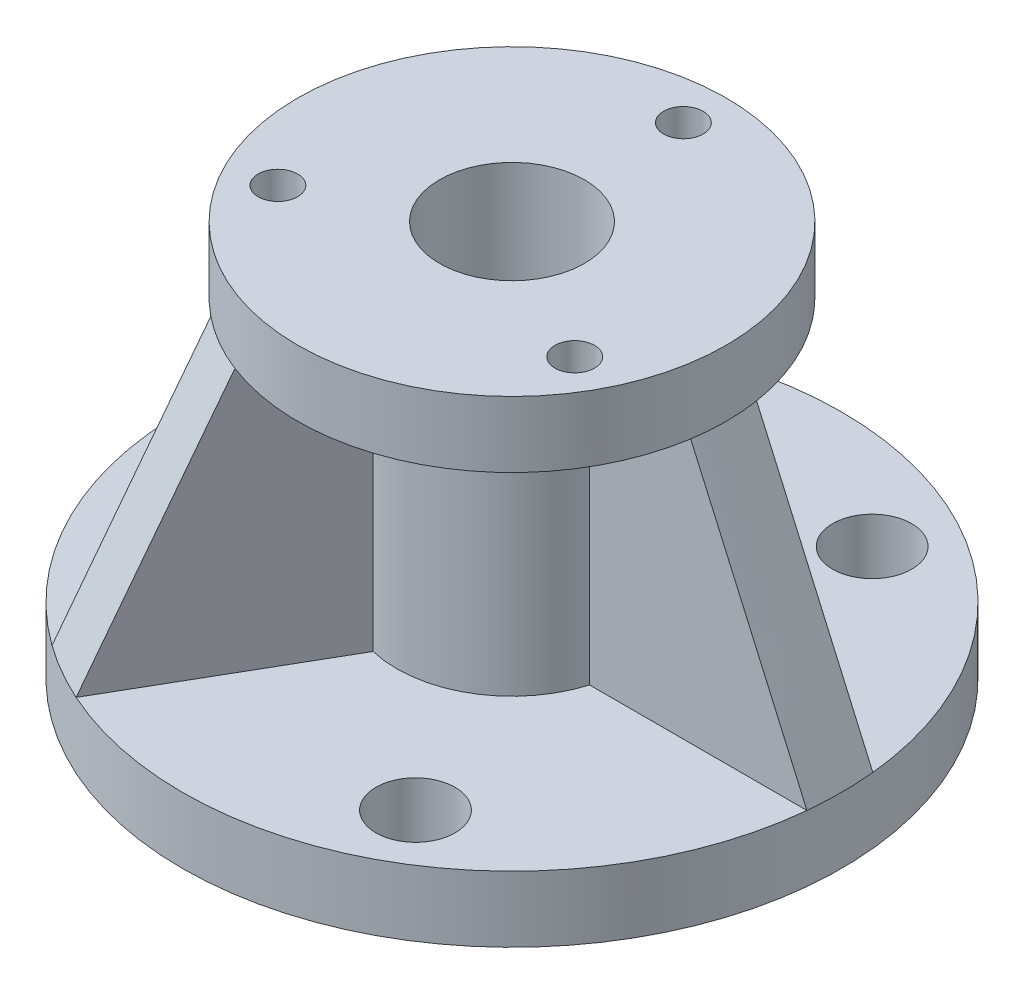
ISO-10303-21;
HEADER;
FILE_DESCRIPTION(('STEP AP214'),'2;1');
FILE_NAME('part.step','',(''),(''),'','','');
FILE_SCHEMA(('AUTOMOTIVE_DESIGN { 1 0 10303 214 1 1 1 1 }'));
ENDSEC;
DATA;
#1=APPLICATION_CONTEXT('core data for automotive mechanical design processes');
#2=APPLICATION_PROTOCOL_DEFINITION('international standard','automotive_design',2000,#1);
#3=PRODUCT_CONTEXT('',#1,'mechanical');
#4=PRODUCT('Part','Part','',(#3));
#5=PRODUCT_RELATED_PRODUCT_CATEGORY('part','',(#4));
#6=PRODUCT_DEFINITION_FORMATION('','',#4);
#7=PRODUCT_DEFINITION_CONTEXT('part definition',#1,'design');
#8=PRODUCT_DEFINITION('design','',#6,#7);
#9=PRODUCT_DEFINITION_SHAPE('','',#8);
#10=(LENGTH_UNIT() NAMED_UNIT(*) SI_UNIT(.MILLI.,.METRE.));
#11=(NAMED_UNIT(*) PLANE_ANGLE_UNIT() SI_UNIT($,.RADIAN.));
#12=(NAMED_UNIT(*) SI_UNIT($,.STERADIAN.) SOLID_ANGLE_UNIT());
#13=UNCERTAINTY_MEASURE_WITH_UNIT(LENGTH_MEASURE(1.E-05),#10,'distance_accuracy_value','');
#14=(GEOMETRIC_REPRESENTATION_CONTEXT(3) GLOBAL_UNCERTAINTY_ASSIGNED_CONTEXT((#13)) GLOBAL_UNIT_ASSIGNED_CONTEXT((#10,
#11,#12)) REPRESENTATION_CONTEXT('',''));
#15=CARTESIAN_POINT('',(0.,0.,0.));
#16=DIRECTION('',(0.,0.,1.));
#17=DIRECTION('',(1.,0.,0.));
#18=AXIS2_PLACEMENT_3D('',#15,#16,#17);
#19=CARTESIAN_POINT('',(-110.141421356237,10.,0.));
#20=DIRECTION('',(0.,1.,0.));
#21=DIRECTION('',(0.,0.,1.));
#22=AXIS2_PLACEMENT_3D('',#19,#20,#21);
#23=PLANE('',#22);
#24=CARTESIAN_POINT('',(19.9999999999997,10.,34.6410161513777));
#25=DIRECTION('',(0.,1.,0.));
#26=DIRECTION('',(0.,0.,1.));
#27=AXIS2_PLACEMENT_3D('',#24,#25,#26);
#28=CIRCLE('',#27,6.);
#29=CARTESIAN_POINT('',(19.9999999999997,10.,40.6410161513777));
#30=VERTEX_POINT('',#29);
#31=EDGE_CURVE('E364',#30,#30,#28,.T.);
#32=ORIENTED_EDGE('',*,*,#31,.F.);
#33=EDGE_LOOP('',(#32));
#34=FACE_BOUND('',#33,.T.);
#35=CARTESIAN_POINT('',(0.,10.,0.));
#36=DIRECTION('',(0.,1.,0.));
#37=DIRECTION('',(0.,0.,1.));
#38=AXIS2_PLACEMENT_3D('',#35,#36,#37);
#39=CIRCLE('',#38,17.5);
#40=CARTESIAN_POINT('',(-4.05512789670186,10.,17.0236875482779));
#41=VERTEX_POINT('',#40);
#42=CARTESIAN_POINT('',(16.7705098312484,10.,5.));
#43=VERTEX_POINT('',#42);
#44=EDGE_CURVE('E59',#41,#43,#39,.T.);
#45=ORIENTED_EDGE('',*,*,#44,.F.);
#46=DIRECTION('',(-0.499999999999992,0.,0.866025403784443));
#47=VECTOR('',#46,1.);
#48=CARTESIAN_POINT('',(4.33012701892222,10.,2.49999999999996));
#49=LINE('',#48,#47);
#50=CARTESIAN_POINT('',(-20.5445589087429,10.,45.5842198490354));
#51=VERTEX_POINT('',#50);
#52=EDGE_CURVE('E296',#51,#41,#49,.F.);
#53=ORIENTED_EDGE('',*,*,#52,.F.);
#54=CARTESIAN_POINT('',(0.,10.,0.));
#55=DIRECTION('',(0.,1.,0.));
#56=DIRECTION('',(0.,0.,1.));
#57=AXIS2_PLACEMENT_3D('',#54,#55,#56);
#58=CIRCLE('',#57,50.);
#59=CARTESIAN_POINT('',(49.7493718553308,10.,4.99999999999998));
#60=VERTEX_POINT('',#59);
#61=EDGE_CURVE('E259',#51,#60,#58,.T.);
#62=ORIENTED_EDGE('',*,*,#61,.T.);
#63=DIRECTION('',(1.,0.,0.));
#64=VECTOR('',#63,1.);
#65=CARTESIAN_POINT('',(0.,10.,5.));
#66=LINE('',#65,#64);
#67=EDGE_CURVE('E348',#60,#43,#66,.F.);
#68=ORIENTED_EDGE('',*,*,#67,.T.);
#69=EDGE_LOOP('',(#45,#53,#62,#68));
#70=FACE_BOUND('',#69,.T.);
#71=ADVANCED_FACE('F31',(#34,#70),#23,.T.);
#72=CARTESIAN_POINT('',(0.,50.,0.));
#73=DIRECTION('',(0.,1.,0.));
#74=DIRECTION('',(0.,0.,1.));
#75=AXIS2_PLACEMENT_3D('',#72,#73,#74);
#76=PLANE('',#75);
#77=CARTESIAN_POINT('',(22.5166604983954,50.,13.0000000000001));
#78=DIRECTION('',(0.,1.,0.));
#79=DIRECTION('',(0.,0.,1.));
#80=AXIS2_PLACEMENT_3D('',#77,#78,#79);
#81=CIRCLE('',#80,3.);
#82=CARTESIAN_POINT('',(22.5166604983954,50.,16.0000000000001));
#83=VERTEX_POINT('',#82);
#84=EDGE_CURVE('E332',#83,#83,#81,.T.);
#85=ORIENTED_EDGE('',*,*,#84,.T.);
#86=EDGE_LOOP('',(#85));
#87=FACE_BOUND('',#86,.T.);
#88=DIRECTION('',(-0.499999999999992,0.,0.866025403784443));
#89=VECTOR('',#88,1.);
#90=CARTESIAN_POINT('',(4.33012701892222,50.,2.49999999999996));
#91=LINE('',#90,#89);
#92=CARTESIAN_POINT('',(-4.05512789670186,50.,17.0236875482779));
#93=VERTEX_POINT('',#92);
#94=CARTESIAN_POINT('',(-11.7264137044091,49.9999999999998,30.3107443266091));
#95=VERTEX_POINT('',#94);
#96=EDGE_CURVE('E150',#93,#95,#91,.T.);
#97=ORIENTED_EDGE('',*,*,#96,.F.);
#98=CARTESIAN_POINT('',(0.,50.,0.));
#99=DIRECTION('',(0.,1.,0.));
#100=DIRECTION('',(0.,0.,1.));
#101=AXIS2_PLACEMENT_3D('',#98,#99,#100);
#102=CIRCLE('',#101,17.5);
#103=CARTESIAN_POINT('',(16.7705098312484,50.,5.));
#104=VERTEX_POINT('',#103);
#105=EDGE_CURVE('E324',#93,#104,#102,.T.);
#106=ORIENTED_EDGE('',*,*,#105,.T.);
#107=DIRECTION('',(1.,0.,0.));
#108=VECTOR('',#107,1.);
#109=CARTESIAN_POINT('',(0.,50.,5.));
#110=LINE('',#109,#108);
#111=CARTESIAN_POINT('',(32.1130814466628,50.,5.));
#112=VERTEX_POINT('',#111);
#113=EDGE_CURVE('E315',#104,#112,#110,.T.);
#114=ORIENTED_EDGE('',*,*,#113,.T.);
#115=CARTESIAN_POINT('',(0.,50.,0.));
#116=DIRECTION('',(0.,1.,0.));
#117=DIRECTION('',(0.,0.,1.));
#118=AXIS2_PLACEMENT_3D('',#115,#116,#117);
#119=CIRCLE('',#118,32.5);
#120=EDGE_CURVE('E313',#95,#112,#119,.T.);
#121=ORIENTED_EDGE('',*,*,#120,.F.);
#122=EDGE_LOOP('',(#97,#106,#114,#121));
#123=FACE_BOUND('',#122,.T.);
#124=ADVANCED_FACE('F215',(#87,#123),#76,.F.);
#125=CARTESIAN_POINT('',(0.,-8.,0.));
#126=DIRECTION('',(0.,1.,0.));
#127=DIRECTION('',(0.,0.,1.));
#128=AXIS2_PLACEMENT_3D('',#125,#126,#127);
#129=CYLINDRICAL_SURFACE('',#128,17.5);
#130=ORIENTED_EDGE('',*,*,#105,.F.);
#131=DIRECTION('',(0.,1.,0.));
#132=VECTOR('',#131,1.);
#133=CARTESIAN_POINT('',(-4.05512789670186,-8.,17.0236875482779));
#134=LINE('',#133,#132);
#135=EDGE_CURVE('E292',#93,#41,#134,.F.);
#136=ORIENTED_EDGE('',*,*,#135,.T.);
#137=ORIENTED_EDGE('',*,*,#44,.T.);
#138=DIRECTION('',(0.,1.,0.));
#139=VECTOR('',#138,1.);
#140=CARTESIAN_POINT('',(16.7705098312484,-8.,5.));
#141=LINE('',#140,#139);
#142=EDGE_CURVE('E341',#104,#43,#141,.F.);
#143=ORIENTED_EDGE('',*,*,#142,.F.);
#144=EDGE_LOOP('',(#130,#136,#137,#143));
#145=FACE_BOUND('',#144,.T.);
#146=ADVANCED_FACE('F223',(#145),#129,.T.);
#147=DIRECTION('',(-0.499999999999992,0.,0.866025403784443));
#148=VECTOR('',#147,1.);
#149=CARTESIAN_POINT('',(-4.33012701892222,10.,-2.49999999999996));
#150=LINE('',#149,#148);
#151=CARTESIAN_POINT('',(-29.2048129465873,9.99999999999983,40.5842198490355));
#152=VERTEX_POINT('',#151);
#153=CARTESIAN_POINT('',(-12.7153819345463,10.,12.0236875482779));
#154=VERTEX_POINT('',#153);
#155=EDGE_CURVE('E289',#152,#154,#150,.F.);
#156=ORIENTED_EDGE('',*,*,#155,.T.);
#157=CARTESIAN_POINT('',(-12.7153819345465,9.99999999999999,-12.0236875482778));
#158=VERTEX_POINT('',#157);
#159=EDGE_CURVE('E274',#158,#154,#39,.T.);
#160=ORIENTED_EDGE('',*,*,#159,.F.);
#161=DIRECTION('',(-0.500000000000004,0.,-0.866025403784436));
#162=VECTOR('',#161,1.);
#163=CARTESIAN_POINT('',(-4.33012701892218,9.99999999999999,2.50000000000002));
#164=LINE('',#163,#162);
#165=CARTESIAN_POINT('',(-29.2048129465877,10.,-40.5842198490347));
#166=VERTEX_POINT('',#165);
#167=EDGE_CURVE('E160',#166,#158,#164,.F.);
#168=ORIENTED_EDGE('',*,*,#167,.F.);
#169=EDGE_CURVE('E257',#166,#152,#58,.T.);
#170=ORIENTED_EDGE('',*,*,#169,.T.);
#171=EDGE_LOOP('',(#156,#160,#168,#170));
#172=FACE_BOUND('',#171,.T.);
#173=CARTESIAN_POINT('',(-40.,10.,0.));
#174=DIRECTION('',(0.,1.,0.));
#175=DIRECTION('',(0.,0.,1.));
#176=AXIS2_PLACEMENT_3D('',#173,#174,#175);
#177=CIRCLE('',#176,5.99999999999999);
#178=CARTESIAN_POINT('',(-40.,10.,5.99999999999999));
#179=VERTEX_POINT('',#178);
#180=EDGE_CURVE('E368',#179,#179,#177,.T.);
#181=ORIENTED_EDGE('',*,*,#180,.F.);
#182=EDGE_LOOP('',(#181));
#183=FACE_BOUND('',#182,.T.);
#184=ADVANCED_FACE('F218',(#172,#183),#23,.T.);
#185=DIRECTION('',(0.,1.,0.));
#186=VECTOR('',#185,1.);
#187=CARTESIAN_POINT('',(-4.0551278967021,-8.,-17.0236875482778));
#188=LINE('',#187,#186);
#189=CARTESIAN_POINT('',(-4.05512789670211,50.,-17.0236875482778));
#190=VERTEX_POINT('',#189);
#191=CARTESIAN_POINT('',(-4.0551278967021,9.99999999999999,-17.0236875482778));
#192=VERTEX_POINT('',#191);
#193=EDGE_CURVE('E172',#190,#192,#188,.F.);
#194=ORIENTED_EDGE('',*,*,#193,.F.);
#195=CARTESIAN_POINT('',(16.7705098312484,50.,-5.));
#196=VERTEX_POINT('',#195);
#197=EDGE_CURVE('E159',#196,#190,#102,.T.);
#198=ORIENTED_EDGE('',*,*,#197,.F.);
#199=DIRECTION('',(0.,1.,0.));
#200=VECTOR('',#199,1.);
#201=CARTESIAN_POINT('',(16.7705098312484,-8.,-5.));
#202=LINE('',#201,#200);
#203=CARTESIAN_POINT('',(16.7705098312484,10.,-5.));
#204=VERTEX_POINT('',#203);
#205=EDGE_CURVE('E345',#196,#204,#202,.F.);
#206=ORIENTED_EDGE('',*,*,#205,.T.);
#207=EDGE_CURVE('E44',#204,#192,#39,.T.);
#208=ORIENTED_EDGE('',*,*,#207,.T.);
#209=EDGE_LOOP('',(#194,#198,#206,#208));
#210=FACE_BOUND('',#209,.T.);
#211=ADVANCED_FACE('F232',(#210),#129,.T.);
#212=CARTESIAN_POINT('',(-12.7153819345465,50.,-12.0236875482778));
#213=VERTEX_POINT('',#212);
#214=CARTESIAN_POINT('',(-12.7153819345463,50.,12.0236875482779));
#215=VERTEX_POINT('',#214);
#216=EDGE_CURVE('E327',#213,#215,#102,.T.);
#217=ORIENTED_EDGE('',*,*,#216,.T.);
#218=DIRECTION('',(-0.499999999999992,0.,0.866025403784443));
#219=VECTOR('',#218,1.);
#220=CARTESIAN_POINT('',(-4.33012701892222,50.,-2.49999999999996));
#221=LINE('',#220,#219);
#222=CARTESIAN_POINT('',(-20.3866677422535,49.9999999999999,25.3107443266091));
#223=VERTEX_POINT('',#222);
#224=EDGE_CURVE('E293',#215,#223,#221,.T.);
#225=ORIENTED_EDGE('',*,*,#224,.T.);
#226=CARTESIAN_POINT('',(-20.3866677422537,50.,-25.3107443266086));
#227=VERTEX_POINT('',#226);
#228=EDGE_CURVE('E137',#227,#223,#119,.T.);
#229=ORIENTED_EDGE('',*,*,#228,.F.);
#230=DIRECTION('',(-0.500000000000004,0.,-0.866025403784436));
#231=VECTOR('',#230,1.);
#232=CARTESIAN_POINT('',(-4.33012701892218,50.,2.50000000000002));
#233=LINE('',#232,#231);
#234=EDGE_CURVE('E164',#213,#227,#233,.T.);
#235=ORIENTED_EDGE('',*,*,#234,.F.);
#236=EDGE_LOOP('',(#217,#225,#229,#235));
#237=FACE_BOUND('',#236,.T.);
#238=CARTESIAN_POINT('',(-22.5166604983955,50.,12.9999999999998));
#239=DIRECTION('',(0.,1.,0.));
#240=DIRECTION('',(0.,0.,1.));
#241=AXIS2_PLACEMENT_3D('',#238,#239,#240);
#242=CIRCLE('',#241,3.);
#243=CARTESIAN_POINT('',(-22.5166604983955,50.,15.9999999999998));
#244=VERTEX_POINT('',#243);
#245=EDGE_CURVE('E338',#244,#244,#242,.T.);
#246=ORIENTED_EDGE('',*,*,#245,.T.);
#247=EDGE_LOOP('',(#246));
#248=FACE_BOUND('',#247,.T.);
#249=ADVANCED_FACE('F226',(#237,#248),#76,.F.);
#250=CARTESIAN_POINT('',(-40.,10.,0.));
#251=DIRECTION('',(0.,-1.,0.));
#252=DIRECTION('',(0.,0.,-1.));
#253=AXIS2_PLACEMENT_3D('',#250,#251,#252);
#254=CYLINDRICAL_SURFACE('',#253,5.99999999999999);
#255=ORIENTED_EDGE('',*,*,#180,.T.);
#256=EDGE_LOOP('',(#255));
#257=FACE_BOUND('',#256,.T.);
#258=CARTESIAN_POINT('',(-40.,0.,0.));
#259=DIRECTION('',(0.,1.,0.));
#260=DIRECTION('',(0.,0.,1.));
#261=AXIS2_PLACEMENT_3D('',#258,#259,#260);
#262=CIRCLE('',#261,5.99999999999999);
#263=CARTESIAN_POINT('',(-40.,0.,5.99999999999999));
#264=VERTEX_POINT('',#263);
#265=EDGE_CURVE('E379',#264,#264,#262,.T.);
#266=ORIENTED_EDGE('',*,*,#265,.F.);
#267=EDGE_LOOP('',(#266));
#268=FACE_BOUND('',#267,.T.);
#269=ADVANCED_FACE('F372',(#257,#268),#254,.F.);
#270=CARTESIAN_POINT('',(20.0000000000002,10.,-34.6410161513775));
#271=DIRECTION('',(0.,-1.,0.));
#272=DIRECTION('',(0.,0.,-1.));
#273=AXIS2_PLACEMENT_3D('',#270,#271,#272);
#274=CYLINDRICAL_SURFACE('',#273,6.);
#275=CARTESIAN_POINT('',(20.0000000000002,10.,-34.6410161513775));
#276=DIRECTION('',(0.,1.,0.));
#277=DIRECTION('',(0.,0.,1.));
#278=AXIS2_PLACEMENT_3D('',#275,#276,#277);
#279=CIRCLE('',#278,6.);
#280=CARTESIAN_POINT('',(20.0000000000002,10.,-28.6410161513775));
#281=VERTEX_POINT('',#280);
#282=EDGE_CURVE('E249',#281,#281,#279,.T.);
#283=ORIENTED_EDGE('',*,*,#282,.T.);
#284=EDGE_LOOP('',(#283));
#285=FACE_BOUND('',#284,.T.);
#286=CARTESIAN_POINT('',(20.0000000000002,0.,-34.6410161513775));
#287=DIRECTION('',(0.,1.,0.));
#288=DIRECTION('',(0.,0.,1.));
#289=AXIS2_PLACEMENT_3D('',#286,#287,#288);
#290=CIRCLE('',#289,6.);
#291=CARTESIAN_POINT('',(20.0000000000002,0.,-28.6410161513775));
#292=VERTEX_POINT('',#291);
#293=EDGE_CURVE('E381',#292,#292,#290,.T.);
#294=ORIENTED_EDGE('',*,*,#293,.F.);
#295=EDGE_LOOP('',(#294));
#296=FACE_BOUND('',#295,.T.);
#297=ADVANCED_FACE('F375',(#285,#296),#274,.F.);
#298=CARTESIAN_POINT('',(19.9999999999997,10.,34.6410161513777));
#299=DIRECTION('',(0.,-1.,0.));
#300=DIRECTION('',(0.,0.,-1.));
#301=AXIS2_PLACEMENT_3D('',#298,#299,#300);
#302=CYLINDRICAL_SURFACE('',#301,6.);
#303=ORIENTED_EDGE('',*,*,#31,.T.);
#304=EDGE_LOOP('',(#303));
#305=FACE_BOUND('',#304,.T.);
#306=CARTESIAN_POINT('',(19.9999999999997,0.,34.6410161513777));
#307=DIRECTION('',(0.,1.,0.));
#308=DIRECTION('',(0.,0.,1.));
#309=AXIS2_PLACEMENT_3D('',#306,#307,#308);
#310=CIRCLE('',#309,6.);
#311=CARTESIAN_POINT('',(19.9999999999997,0.,40.6410161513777));
#312=VERTEX_POINT('',#311);
#313=EDGE_CURVE('E386',#312,#312,#310,.T.);
#314=ORIENTED_EDGE('',*,*,#313,.F.);
#315=EDGE_LOOP('',(#314));
#316=FACE_BOUND('',#315,.T.);
#317=ADVANCED_FACE('F33',(#305,#316),#302,.F.);
#318=CARTESIAN_POINT('',(0.,10.,0.));
#319=DIRECTION('',(0.,-1.,0.));
#320=DIRECTION('',(0.,0.,-1.));
#321=AXIS2_PLACEMENT_3D('',#318,#319,#320);
#322=CYLINDRICAL_SURFACE('',#321,50.);
#323=CARTESIAN_POINT('',(49.7493718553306,10.,-4.99999999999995));
#324=VERTEX_POINT('',#323);
#325=EDGE_CURVE('E256',#60,#324,#58,.T.);
#326=ORIENTED_EDGE('',*,*,#325,.F.);
#327=ORIENTED_EDGE('',*,*,#61,.F.);
#328=CARTESIAN_POINT('',(0.,10.,0.));
#329=DIRECTION('',(0.,1.,0.));
#330=DIRECTION('',(0.,0.,1.));
#331=AXIS2_PLACEMENT_3D('',#328,#329,#330);
#332=CIRCLE('',#331,50.);
#333=EDGE_CURVE('E169',#51,#152,#332,.F.);
#334=ORIENTED_EDGE('',*,*,#333,.T.);
#335=ORIENTED_EDGE('',*,*,#169,.F.);
#336=CARTESIAN_POINT('',(-20.5445589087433,9.99999999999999,-45.5842198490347));
#337=VERTEX_POINT('',#336);
#338=EDGE_CURVE('E174',#337,#166,#58,.T.);
#339=ORIENTED_EDGE('',*,*,#338,.F.);
#340=EDGE_CURVE('E252',#324,#337,#58,.T.);
#341=ORIENTED_EDGE('',*,*,#340,.F.);
#342=EDGE_LOOP('',(#326,#327,#334,#335,#339,#341));
#343=FACE_BOUND('',#342,.T.);
#344=CARTESIAN_POINT('',(0.,0.,0.));
#345=DIRECTION('',(0.,1.,0.));
#346=DIRECTION('',(0.,0.,1.));
#347=AXIS2_PLACEMENT_3D('',#344,#345,#346);
#348=CIRCLE('',#347,50.);
#349=CARTESIAN_POINT('',(0.,0.,50.));
#350=VERTEX_POINT('',#349);
#351=EDGE_CURVE('E367',#350,#350,#348,.T.);
#352=ORIENTED_EDGE('',*,*,#351,.T.);
#353=EDGE_LOOP('',(#352));
#354=FACE_BOUND('',#353,.T.);
#355=ADVANCED_FACE('F236',(#343,#354),#322,.T.);
#356=ORIENTED_EDGE('',*,*,#282,.F.);
#357=EDGE_LOOP('',(#356));
#358=FACE_BOUND('',#357,.T.);
#359=ORIENTED_EDGE('',*,*,#340,.T.);
#360=DIRECTION('',(-0.500000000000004,0.,-0.866025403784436));
#361=VECTOR('',#360,1.);
#362=CARTESIAN_POINT('',(4.33012701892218,9.99999999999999,-2.50000000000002));
#363=LINE('',#362,#361);
#364=EDGE_CURVE('E148',#337,#192,#363,.F.);
#365=ORIENTED_EDGE('',*,*,#364,.T.);
#366=ORIENTED_EDGE('',*,*,#207,.F.);
#367=DIRECTION('',(1.,0.,0.));
#368=VECTOR('',#367,1.);
#369=CARTESIAN_POINT('',(0.,10.,-5.));
#370=LINE('',#369,#368);
#371=EDGE_CURVE('E254',#324,#204,#370,.F.);
#372=ORIENTED_EDGE('',*,*,#371,.F.);
#373=EDGE_LOOP('',(#359,#365,#366,#372));
#374=FACE_BOUND('',#373,.T.);
#375=ADVANCED_FACE('F219',(#358,#374),#23,.T.);
#376=CARTESIAN_POINT('',(-110.141421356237,0.,0.));
#377=DIRECTION('',(0.,1.,0.));
#378=DIRECTION('',(0.,0.,1.));
#379=AXIS2_PLACEMENT_3D('',#376,#377,#378);
#380=PLANE('',#379);
#381=CARTESIAN_POINT('',(0.,0.,0.));
#382=DIRECTION('',(0.,1.,0.));
#383=DIRECTION('',(0.,0.,1.));
#384=AXIS2_PLACEMENT_3D('',#381,#382,#383);
#385=CIRCLE('',#384,17.5);
#386=CARTESIAN_POINT('',(0.,0.,17.5));
#387=VERTEX_POINT('',#386);
#388=EDGE_CURVE('E359',#387,#387,#385,.T.);
#389=ORIENTED_EDGE('',*,*,#388,.T.);
#390=EDGE_LOOP('',(#389));
#391=FACE_BOUND('',#390,.T.);
#392=ORIENTED_EDGE('',*,*,#313,.T.);
#393=EDGE_LOOP('',(#392));
#394=FACE_BOUND('',#393,.T.);
#395=ORIENTED_EDGE('',*,*,#293,.T.);
#396=EDGE_LOOP('',(#395));
#397=FACE_BOUND('',#396,.T.);
#398=ORIENTED_EDGE('',*,*,#265,.T.);
#399=EDGE_LOOP('',(#398));
#400=FACE_BOUND('',#399,.T.);
#401=ORIENTED_EDGE('',*,*,#351,.F.);
#402=EDGE_LOOP('',(#401));
#403=FACE_BOUND('',#402,.T.);
#404=ADVANCED_FACE('F235',(#391,#394,#397,#400,#403),#380,.F.);
#405=CARTESIAN_POINT('',(-110.141421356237,-8.,0.));
#406=DIRECTION('',(0.,1.,0.));
#407=DIRECTION('',(0.,0.,1.));
#408=AXIS2_PLACEMENT_3D('',#405,#406,#407);
#409=PLANE('',#408);
#410=CARTESIAN_POINT('',(0.,-8.,0.));
#411=DIRECTION('',(0.,-1.,0.));
#412=DIRECTION('',(0.,0.,-1.));
#413=AXIS2_PLACEMENT_3D('',#410,#411,#412);
#414=CIRCLE('',#413,11.);
#415=CARTESIAN_POINT('',(0.,-8.,-11.));
#416=VERTEX_POINT('',#415);
#417=EDGE_CURVE('E620',#416,#416,#414,.T.);
#418=ORIENTED_EDGE('',*,*,#417,.F.);
#419=EDGE_LOOP('',(#418));
#420=FACE_BOUND('',#419,.T.);
#421=CARTESIAN_POINT('',(0.,-8.,0.));
#422=DIRECTION('',(0.,1.,0.));
#423=DIRECTION('',(0.,0.,1.));
#424=AXIS2_PLACEMENT_3D('',#421,#422,#423);
#425=CIRCLE('',#424,17.5);
#426=CARTESIAN_POINT('',(0.,-8.,17.5));
#427=VERTEX_POINT('',#426);
#428=EDGE_CURVE('E357',#427,#427,#425,.T.);
#429=ORIENTED_EDGE('',*,*,#428,.F.);
#430=EDGE_LOOP('',(#429));
#431=FACE_BOUND('',#430,.T.);
#432=ADVANCED_FACE('F242',(#420,#431),#409,.F.);
#433=ORIENTED_EDGE('',*,*,#428,.T.);
#434=EDGE_LOOP('',(#433));
#435=FACE_BOUND('',#434,.T.);
#436=ORIENTED_EDGE('',*,*,#388,.F.);
#437=EDGE_LOOP('',(#436));
#438=FACE_BOUND('',#437,.T.);
#439=ADVANCED_FACE('F423',(#435,#438),#129,.T.);
#440=DIRECTION('',(0.,1.,0.));
#441=VECTOR('',#440,1.);
#442=CARTESIAN_POINT('',(-12.7153819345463,-8.,12.0236875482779));
#443=LINE('',#442,#441);
#444=EDGE_CURVE('E280',#215,#154,#443,.F.);
#445=ORIENTED_EDGE('',*,*,#444,.F.);
#446=ORIENTED_EDGE('',*,*,#216,.F.);
#447=DIRECTION('',(0.,1.,0.));
#448=VECTOR('',#447,1.);
#449=CARTESIAN_POINT('',(-12.7153819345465,-8.,-12.0236875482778));
#450=LINE('',#449,#448);
#451=EDGE_CURVE('E162',#213,#158,#450,.F.);
#452=ORIENTED_EDGE('',*,*,#451,.T.);
#453=ORIENTED_EDGE('',*,*,#159,.T.);
#454=EDGE_LOOP('',(#445,#446,#452,#453));
#455=FACE_BOUND('',#454,.T.);
#456=ADVANCED_FACE('F433',(#455),#129,.T.);
#457=CARTESIAN_POINT('',(0.,60.,0.));
#458=DIRECTION('',(0.,1.,0.));
#459=DIRECTION('',(0.,0.,1.));
#460=AXIS2_PLACEMENT_3D('',#457,#458,#459);
#461=PLANE('',#460);
#462=CARTESIAN_POINT('',(0.,60.,0.));
#463=DIRECTION('',(0.,-1.,0.));
#464=DIRECTION('',(0.,0.,-1.));
#465=AXIS2_PLACEMENT_3D('',#462,#463,#464);
#466=CIRCLE('',#465,11.);
#467=CARTESIAN_POINT('',(0.,60.,-11.));
#468=VERTEX_POINT('',#467);
#469=EDGE_CURVE('E287',#468,#468,#466,.T.);
#470=ORIENTED_EDGE('',*,*,#469,.T.);
#471=EDGE_LOOP('',(#470));
#472=FACE_BOUND('',#471,.T.);
#473=CARTESIAN_POINT('',(22.5166604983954,60.,13.0000000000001));
#474=DIRECTION('',(0.,1.,0.));
#475=DIRECTION('',(0.,0.,1.));
#476=AXIS2_PLACEMENT_3D('',#473,#474,#475);
#477=CIRCLE('',#476,3.);
#478=CARTESIAN_POINT('',(22.5166604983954,60.,16.0000000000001));
#479=VERTEX_POINT('',#478);
#480=EDGE_CURVE('E330',#479,#479,#477,.T.);
#481=ORIENTED_EDGE('',*,*,#480,.F.);
#482=EDGE_LOOP('',(#481));
#483=FACE_BOUND('',#482,.T.);
#484=CARTESIAN_POINT('',(0.,60.,0.));
#485=DIRECTION('',(0.,1.,0.));
#486=DIRECTION('',(0.,0.,1.));
#487=AXIS2_PLACEMENT_3D('',#484,#485,#486);
#488=CIRCLE('',#487,32.5);
#489=CARTESIAN_POINT('',(0.,60.,32.5));
#490=VERTEX_POINT('',#489);
#491=EDGE_CURVE('E322',#490,#490,#488,.T.);
#492=ORIENTED_EDGE('',*,*,#491,.T.);
#493=EDGE_LOOP('',(#492));
#494=FACE_BOUND('',#493,.T.);
#495=CARTESIAN_POINT('',(0.,60.,-26.));
#496=DIRECTION('',(0.,1.,0.));
#497=DIRECTION('',(0.,0.,1.));
#498=AXIS2_PLACEMENT_3D('',#495,#496,#497);
#499=CIRCLE('',#498,3.);
#500=CARTESIAN_POINT('',(0.,60.,-23.));
#501=VERTEX_POINT('',#500);
#502=EDGE_CURVE('E316',#501,#501,#499,.T.);
#503=ORIENTED_EDGE('',*,*,#502,.F.);
#504=EDGE_LOOP('',(#503));
#505=FACE_BOUND('',#504,.T.);
#506=CARTESIAN_POINT('',(-22.5166604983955,60.,12.9999999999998));
#507=DIRECTION('',(0.,1.,0.));
#508=DIRECTION('',(0.,0.,1.));
#509=AXIS2_PLACEMENT_3D('',#506,#507,#508);
#510=CIRCLE('',#509,3.);
#511=CARTESIAN_POINT('',(-22.5166604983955,60.,15.9999999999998));
#512=VERTEX_POINT('',#511);
#513=EDGE_CURVE('E335',#512,#512,#510,.T.);
#514=ORIENTED_EDGE('',*,*,#513,.F.);
#515=EDGE_LOOP('',(#514));
#516=FACE_BOUND('',#515,.T.);
#517=ADVANCED_FACE('F502',(#472,#483,#494,#505,#516),#461,.T.);
#518=DIRECTION('',(-0.500000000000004,0.,-0.866025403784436));
#519=VECTOR('',#518,1.);
#520=CARTESIAN_POINT('',(4.33012701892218,50.,-2.50000000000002));
#521=LINE('',#520,#519);
#522=CARTESIAN_POINT('',(-11.7264137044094,50.,-30.3107443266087));
#523=VERTEX_POINT('',#522);
#524=EDGE_CURVE('E145',#190,#523,#521,.T.);
#525=ORIENTED_EDGE('',*,*,#524,.T.);
#526=CARTESIAN_POINT('',(32.1130814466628,50.,-5.));
#527=VERTEX_POINT('',#526);
#528=EDGE_CURVE('E136',#527,#523,#119,.T.);
#529=ORIENTED_EDGE('',*,*,#528,.F.);
#530=DIRECTION('',(1.,0.,0.));
#531=VECTOR('',#530,1.);
#532=CARTESIAN_POINT('',(0.,50.,-5.));
#533=LINE('',#532,#531);
#534=EDGE_CURVE('E349',#196,#527,#533,.T.);
#535=ORIENTED_EDGE('',*,*,#534,.F.);
#536=ORIENTED_EDGE('',*,*,#197,.T.);
#537=EDGE_LOOP('',(#525,#529,#535,#536));
#538=FACE_BOUND('',#537,.T.);
#539=CARTESIAN_POINT('',(0.,50.,-26.));
#540=DIRECTION('',(0.,1.,0.));
#541=DIRECTION('',(0.,0.,1.));
#542=AXIS2_PLACEMENT_3D('',#539,#540,#541);
#543=CIRCLE('',#542,3.);
#544=CARTESIAN_POINT('',(0.,50.,-23.));
#545=VERTEX_POINT('',#544);
#546=EDGE_CURVE('E318',#545,#545,#543,.T.);
#547=ORIENTED_EDGE('',*,*,#546,.T.);
#548=EDGE_LOOP('',(#547));
#549=FACE_BOUND('',#548,.T.);
#550=ADVANCED_FACE('F156',(#538,#549),#76,.F.);
#551=CARTESIAN_POINT('',(0.,60.,0.));
#552=DIRECTION('',(0.,-1.,0.));
#553=DIRECTION('',(0.,0.,-1.));
#554=AXIS2_PLACEMENT_3D('',#551,#552,#553);
#555=CYLINDRICAL_SURFACE('',#554,32.5);
#556=ORIENTED_EDGE('',*,*,#491,.F.);
#557=EDGE_LOOP('',(#556));
#558=FACE_BOUND('',#557,.T.);
#559=EDGE_CURVE('E51',#112,#527,#119,.T.);
#560=ORIENTED_EDGE('',*,*,#559,.T.);
#561=ORIENTED_EDGE('',*,*,#528,.T.);
#562=EDGE_CURVE('E127',#523,#227,#119,.T.);
#563=ORIENTED_EDGE('',*,*,#562,.T.);
#564=ORIENTED_EDGE('',*,*,#228,.T.);
#565=EDGE_CURVE('E284',#223,#95,#119,.T.);
#566=ORIENTED_EDGE('',*,*,#565,.T.);
#567=ORIENTED_EDGE('',*,*,#120,.T.);
#568=EDGE_LOOP('',(#560,#561,#563,#564,#566,#567));
#569=FACE_BOUND('',#568,.T.);
#570=ADVANCED_FACE('F153',(#558,#569),#555,.T.);
#571=CARTESIAN_POINT('',(0.,60.,-26.));
#572=DIRECTION('',(0.,-1.,0.));
#573=DIRECTION('',(0.,0.,-1.));
#574=AXIS2_PLACEMENT_3D('',#571,#572,#573);
#575=CYLINDRICAL_SURFACE('',#574,3.);
#576=ORIENTED_EDGE('',*,*,#502,.T.);
#577=EDGE_LOOP('',(#576));
#578=FACE_BOUND('',#577,.T.);
#579=ORIENTED_EDGE('',*,*,#546,.F.);
#580=EDGE_LOOP('',(#579));
#581=FACE_BOUND('',#580,.T.);
#582=ADVANCED_FACE('F475',(#578,#581),#575,.F.);
#583=CARTESIAN_POINT('',(22.5166604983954,60.,13.0000000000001));
#584=DIRECTION('',(0.,-1.,0.));
#585=DIRECTION('',(0.,0.,-1.));
#586=AXIS2_PLACEMENT_3D('',#583,#584,#585);
#587=CYLINDRICAL_SURFACE('',#586,3.);
#588=ORIENTED_EDGE('',*,*,#480,.T.);
#589=EDGE_LOOP('',(#588));
#590=FACE_BOUND('',#589,.T.);
#591=ORIENTED_EDGE('',*,*,#84,.F.);
#592=EDGE_LOOP('',(#591));
#593=FACE_BOUND('',#592,.T.);
#594=ADVANCED_FACE('F211',(#590,#593),#587,.F.);
#595=CARTESIAN_POINT('',(-22.5166604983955,60.,12.9999999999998));
#596=DIRECTION('',(0.,-1.,0.));
#597=DIRECTION('',(0.,0.,-1.));
#598=AXIS2_PLACEMENT_3D('',#595,#596,#597);
#599=CYLINDRICAL_SURFACE('',#598,3.);
#600=ORIENTED_EDGE('',*,*,#513,.T.);
#601=EDGE_LOOP('',(#600));
#602=FACE_BOUND('',#601,.T.);
#603=ORIENTED_EDGE('',*,*,#245,.F.);
#604=EDGE_LOOP('',(#603));
#605=FACE_BOUND('',#604,.T.);
#606=ADVANCED_FACE('F204',(#602,#605),#599,.F.);
#607=CARTESIAN_POINT('',(0.,26.,5.));
#608=DIRECTION('',(0.,0.,1.));
#609=DIRECTION('',(1.,0.,0.));
#610=AXIS2_PLACEMENT_3D('',#607,#608,#609);
#611=PLANE('',#610);
#612=CARTESIAN_POINT('',(19.7689257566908,77.6767309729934,5.));
#613=CARTESIAN_POINT('',(20.26789018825,76.5710144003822,5.));
#614=CARTESIAN_POINT('',(20.7659435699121,75.4648872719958,5.));
#615=CARTESIAN_POINT('',(21.7605216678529,73.2519467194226,5.));
#616=CARTESIAN_POINT('',(22.2570463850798,72.1451332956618,5.));
#617=CARTESIAN_POINT('',(23.2488602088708,69.9309558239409,5.));
#618=CARTESIAN_POINT('',(23.7441493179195,68.8235917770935,5.));
#619=CARTESIAN_POINT('',(24.7336981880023,66.6084036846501,5.));
#620=CARTESIAN_POINT('',(25.2279579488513,65.5005796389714,5.));
#621=CARTESIAN_POINT('',(26.7094484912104,62.1765453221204,5.));
#622=CARTESIAN_POINT('',(27.695395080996,59.9597627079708,5.));
#623=CARTESIAN_POINT('',(29.6648180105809,55.5250993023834,5.));
#624=CARTESIAN_POINT('',(30.6482943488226,53.3072185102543,5.));
#625=CARTESIAN_POINT('',(32.9388693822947,48.1358381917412,5.));
#626=CARTESIAN_POINT('',(34.2452555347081,45.1820230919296,5.));
#627=CARTESIAN_POINT('',(36.8557255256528,39.2733767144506,5.));
#628=CARTESIAN_POINT('',(38.159809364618,36.3185454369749,5.));
#629=CARTESIAN_POINT('',(40.7662893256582,30.4081277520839,5.));
#630=CARTESIAN_POINT('',(42.0686854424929,27.4525413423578,5.));
#631=CARTESIAN_POINT('',(44.672198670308,21.5408052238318,5.));
#632=CARTESIAN_POINT('',(45.973315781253,18.5846555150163,5.));
#633=CARTESIAN_POINT('',(49.5515578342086,10.4511967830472,5.));
#634=CARTESIAN_POINT('',(51.8276687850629,5.27344168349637,5.));
#635=CARTESIAN_POINT('',(56.3778891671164,-5.08294790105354,5.));
#636=CARTESIAN_POINT('',(58.6519985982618,-10.2615823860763,5.));
#637=CARTESIAN_POINT('',(63.1987955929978,-20.6194313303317,5.));
#638=CARTESIAN_POINT('',(65.4714831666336,-25.7986457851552,5.));
#639=CARTESIAN_POINT('',(70.015808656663,-36.1575345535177,5.));
#640=CARTESIAN_POINT('',(72.2874465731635,-41.3372088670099,5.));
#641=CARTESIAN_POINT('',(74.5587378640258,-46.5170350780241,5.));
#642=B_SPLINE_CURVE_WITH_KNOTS('',3,(#612,#613,#614,#615,#616,#617,#618,#619,#620,#621,#622,
#623,#624,#625,#626,#627,#628,#629,#630,#631,#632,#633,#634,#635,#636,#637,#638,#639,#640,#641),
.UNSPECIFIED.,.F.,.F.,(4,2,2,2,2,2,2,2,2,2,2,2,2,2,4),(0.,3.6392531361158,7.27850401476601,
10.9177475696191,14.5569917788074,21.8354467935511,29.1139063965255,38.803332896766,
48.4927575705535,58.1822122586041,67.8716672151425,84.8395320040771,101.807397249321,
118.775141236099,135.742883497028),.UNSPECIFIED.);
#643=EDGE_CURVE('E183',#112,#60,#642,.T.);
#644=ORIENTED_EDGE('',*,*,#643,.F.);
#645=ORIENTED_EDGE('',*,*,#113,.F.);
#646=ORIENTED_EDGE('',*,*,#142,.T.);
#647=ORIENTED_EDGE('',*,*,#67,.F.);
#648=EDGE_LOOP('',(#644,#645,#646,#647));
#649=FACE_BOUND('',#648,.T.);
#650=ADVANCED_FACE('F200',(#649),#611,.T.);
#651=CARTESIAN_POINT('',(0.,26.,-5.));
#652=DIRECTION('',(0.,0.,1.));
#653=DIRECTION('',(1.,0.,0.));
#654=AXIS2_PLACEMENT_3D('',#651,#652,#653);
#655=PLANE('',#654);
#656=ORIENTED_EDGE('',*,*,#534,.T.);
#657=CARTESIAN_POINT('',(19.7689257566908,77.6767309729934,-5.));
#658=CARTESIAN_POINT('',(20.26789018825,76.5710144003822,-5.));
#659=CARTESIAN_POINT('',(20.7659435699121,75.4648872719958,-5.));
#660=CARTESIAN_POINT('',(21.7605216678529,73.2519467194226,-5.));
#661=CARTESIAN_POINT('',(22.2570463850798,72.1451332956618,-5.));
#662=CARTESIAN_POINT('',(23.2488602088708,69.9309558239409,-5.));
#663=CARTESIAN_POINT('',(23.7441493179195,68.8235917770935,-5.));
#664=CARTESIAN_POINT('',(24.7336981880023,66.6084036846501,-5.));
#665=CARTESIAN_POINT('',(25.2279579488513,65.5005796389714,-5.));
#666=CARTESIAN_POINT('',(26.7094484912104,62.1765453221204,-5.));
#667=CARTESIAN_POINT('',(27.695395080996,59.9597627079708,-5.));
#668=CARTESIAN_POINT('',(29.6648180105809,55.5250993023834,-5.));
#669=CARTESIAN_POINT('',(30.6482943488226,53.3072185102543,-5.));
#670=CARTESIAN_POINT('',(32.9388693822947,48.1358381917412,-5.));
#671=CARTESIAN_POINT('',(34.2452555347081,45.1820230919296,-5.));
#672=CARTESIAN_POINT('',(36.8557255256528,39.2733767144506,-5.));
#673=CARTESIAN_POINT('',(38.159809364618,36.3185454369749,-5.));
#674=CARTESIAN_POINT('',(40.7662893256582,30.4081277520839,-5.));
#675=CARTESIAN_POINT('',(42.0686854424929,27.4525413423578,-5.));
#676=CARTESIAN_POINT('',(44.672198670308,21.5408052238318,-5.));
#677=CARTESIAN_POINT('',(45.973315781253,18.5846555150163,-5.));
#678=CARTESIAN_POINT('',(49.5515578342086,10.4511967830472,-5.));
#679=CARTESIAN_POINT('',(51.8276687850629,5.27344168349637,-5.));
#680=CARTESIAN_POINT('',(56.3778891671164,-5.08294790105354,-5.));
#681=CARTESIAN_POINT('',(58.6519985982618,-10.2615823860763,-5.));
#682=CARTESIAN_POINT('',(63.1987955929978,-20.6194313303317,-5.));
#683=CARTESIAN_POINT('',(65.4714831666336,-25.7986457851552,-5.));
#684=CARTESIAN_POINT('',(70.015808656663,-36.1575345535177,-5.));
#685=CARTESIAN_POINT('',(72.2874465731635,-41.3372088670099,-5.));
#686=CARTESIAN_POINT('',(74.5587378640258,-46.5170350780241,-5.));
#687=B_SPLINE_CURVE_WITH_KNOTS('',3,(#657,#658,#659,#660,#661,#662,#663,#664,#665,#666,#667,
#668,#669,#670,#671,#672,#673,#674,#675,#676,#677,#678,#679,#680,#681,#682,#683,#684,#685,#686),
.UNSPECIFIED.,.F.,.F.,(4,2,2,2,2,2,2,2,2,2,2,2,2,2,4),(0.,3.6392531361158,7.27850401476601,
10.9177475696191,14.5569917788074,21.8354467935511,29.1139063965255,38.803332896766,
48.4927575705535,58.1822122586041,67.8716672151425,84.8395320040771,101.807397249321,
118.775141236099,135.742883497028),.UNSPECIFIED.);
#688=EDGE_CURVE('E175',#527,#324,#687,.T.);
#689=ORIENTED_EDGE('',*,*,#688,.T.);
#690=ORIENTED_EDGE('',*,*,#371,.T.);
#691=ORIENTED_EDGE('',*,*,#205,.F.);
#692=EDGE_LOOP('',(#656,#689,#690,#691));
#693=FACE_BOUND('',#692,.T.);
#694=ADVANCED_FACE('F189',(#693),#655,.F.);
#695=CARTESIAN_POINT('',(-1.74546270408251E-13,49.9999999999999,0.));
#696=DIRECTION('',(0.,-1.,0.));
#697=DIRECTION('',(1.,0.,0.));
#698=AXIS2_PLACEMENT_3D('',#695,#696,#697);
#699=CONICAL_SURFACE('',#698,32.5000000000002,0.412410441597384);
#700=ORIENTED_EDGE('',*,*,#688,.F.);
#701=ORIENTED_EDGE('',*,*,#559,.F.);
#702=ORIENTED_EDGE('',*,*,#643,.T.);
#703=ORIENTED_EDGE('',*,*,#325,.T.);
#704=EDGE_LOOP('',(#700,#701,#702,#703));
#705=FACE_BOUND('',#704,.T.);
#706=ADVANCED_FACE('F192',(#705),#699,.T.);
#707=CARTESIAN_POINT('',(4.33012701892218,26.,-2.50000000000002));
#708=DIRECTION('',(0.866025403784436,0.,-0.500000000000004));
#709=DIRECTION('',(-0.500000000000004,0.,-0.866025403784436));
#710=AXIS2_PLACEMENT_3D('',#707,#708,#709);
#711=PLANE('',#710);
#712=CARTESIAN_POINT('',(-11.7263694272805,50.0002,-30.3106676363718));
#713=CARTESIAN_POINT('',(-12.0950920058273,48.3346607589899,-30.9493138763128));
#714=CARTESIAN_POINT('',(-12.4635700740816,46.6689051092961,-31.587536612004));
#715=CARTESIAN_POINT('',(-13.2001124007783,43.3370280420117,-32.8632653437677));
#716=CARTESIAN_POINT('',(-13.5681766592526,41.6709066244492,-33.5007713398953));
#717=CARTESIAN_POINT('',(-14.6718613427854,36.672095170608,-35.4124092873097));
#718=CARTESIAN_POINT('',(-15.4069739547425,33.3389566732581,-36.685661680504));
#719=CARTESIAN_POINT('',(-16.8762417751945,26.6718368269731,-39.2305081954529));
#720=CARTESIAN_POINT('',(-17.6103969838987,23.3378554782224,-40.5021023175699));
#721=CARTESIAN_POINT('',(-19.0779840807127,16.669254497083,-43.0440377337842));
#722=CARTESIAN_POINT('',(-19.8114159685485,13.3346348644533,-44.314379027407));
#723=CARTESIAN_POINT('',(-20.5446028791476,9.99979999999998,-45.5842960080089));
#724=B_SPLINE_CURVE_WITH_KNOTS('',3,(#712,#713,#714,#715,#716,#717,#718,#719,#720,#721,#722,
#723),.UNSPECIFIED.,.F.,.F.,(4,2,2,2,2,4),(0.,5.46448665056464,10.9289728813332,21.857941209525,
32.7869071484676,43.7158772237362),.UNSPECIFIED.);
#725=EDGE_CURVE('E130',#523,#337,#724,.T.);
#726=ORIENTED_EDGE('',*,*,#725,.F.);
#727=ORIENTED_EDGE('',*,*,#524,.F.);
#728=ORIENTED_EDGE('',*,*,#193,.T.);
#729=ORIENTED_EDGE('',*,*,#364,.F.);
#730=EDGE_LOOP('',(#726,#727,#728,#729));
#731=FACE_BOUND('',#730,.T.);
#732=ADVANCED_FACE('F142',(#731),#711,.T.);
#733=CARTESIAN_POINT('',(-4.33012701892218,26.,2.50000000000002));
#734=DIRECTION('',(0.866025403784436,0.,-0.500000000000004));
#735=DIRECTION('',(-0.500000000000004,0.,-0.866025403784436));
#736=AXIS2_PLACEMENT_3D('',#733,#734,#735);
#737=PLANE('',#736);
#738=ORIENTED_EDGE('',*,*,#234,.T.);
#739=CARTESIAN_POINT('',(-20.3866234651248,50.0002,-25.3106676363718));
#740=CARTESIAN_POINT('',(-20.7553460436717,48.3346607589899,-25.9493138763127));
#741=CARTESIAN_POINT('',(-21.1238241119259,46.6689051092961,-26.587536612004));
#742=CARTESIAN_POINT('',(-21.8603664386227,43.3370280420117,-27.8632653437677));
#743=CARTESIAN_POINT('',(-22.228430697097,41.6709066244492,-28.5007713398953));
#744=CARTESIAN_POINT('',(-23.3321153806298,36.672095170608,-30.4124092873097));
#745=CARTESIAN_POINT('',(-24.0672279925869,33.3389566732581,-31.685661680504));
#746=CARTESIAN_POINT('',(-25.5364958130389,26.6718368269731,-34.2305081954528));
#747=CARTESIAN_POINT('',(-26.2706510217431,23.3378554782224,-35.5021023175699));
#748=CARTESIAN_POINT('',(-27.738238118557,16.669254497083,-38.0440377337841));
#749=CARTESIAN_POINT('',(-28.4716700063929,13.3346348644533,-39.314379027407));
#750=CARTESIAN_POINT('',(-29.2048569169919,9.99979999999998,-40.5842960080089));
#751=B_SPLINE_CURVE_WITH_KNOTS('',3,(#739,#740,#741,#742,#743,#744,#745,#746,#747,#748,#749,
#750),.UNSPECIFIED.,.F.,.F.,(4,2,2,2,2,4),(0.,5.46448665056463,10.9289728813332,21.857941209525,
32.7869071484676,43.7158772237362),.UNSPECIFIED.);
#752=EDGE_CURVE('E133',#227,#166,#751,.T.);
#753=ORIENTED_EDGE('',*,*,#752,.T.);
#754=ORIENTED_EDGE('',*,*,#167,.T.);
#755=ORIENTED_EDGE('',*,*,#451,.F.);
#756=EDGE_LOOP('',(#738,#753,#754,#755));
#757=FACE_BOUND('',#756,.T.);
#758=ADVANCED_FACE('F197',(#757),#737,.F.);
#759=CARTESIAN_POINT('',(-4.33012701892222,26.,-2.49999999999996));
#760=DIRECTION('',(-0.866025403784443,0.,-0.499999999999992));
#761=DIRECTION('',(-0.499999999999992,0.,0.866025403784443));
#762=AXIS2_PLACEMENT_3D('',#759,#760,#761);
#763=PLANE('',#762);
#764=CARTESIAN_POINT('',(-20.3866234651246,50.0002,25.3106676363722));
#765=CARTESIAN_POINT('',(-20.7553460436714,48.3346607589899,25.9493138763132));
#766=CARTESIAN_POINT('',(-21.1238241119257,46.6689051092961,26.5875366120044));
#767=CARTESIAN_POINT('',(-21.8603664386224,43.3370280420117,27.8632653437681));
#768=CARTESIAN_POINT('',(-22.2284306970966,41.6709066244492,28.5007713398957));
#769=CARTESIAN_POINT('',(-23.3321153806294,36.672095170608,30.4124092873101));
#770=CARTESIAN_POINT('',(-24.0672279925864,33.3389566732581,31.6856616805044));
#771=CARTESIAN_POINT('',(-25.5364958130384,26.6718368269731,34.2305081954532));
#772=CARTESIAN_POINT('',(-26.2706510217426,23.3378554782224,35.5021023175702));
#773=CARTESIAN_POINT('',(-27.7382381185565,16.6692544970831,38.0440377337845));
#774=CARTESIAN_POINT('',(-28.4716700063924,13.3346348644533,39.3143790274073));
#775=CARTESIAN_POINT('',(-29.2048569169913,9.9998,40.5842960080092));
#776=B_SPLINE_CURVE_WITH_KNOTS('',3,(#764,#765,#766,#767,#768,#769,#770,#771,#772,#773,#774,
#775),.UNSPECIFIED.,.F.,.F.,(4,2,2,2,2,4),(0.,5.46448665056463,10.9289728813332,21.857941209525,
32.7869071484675,43.7158772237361),.UNSPECIFIED.);
#777=EDGE_CURVE('E268',#223,#152,#776,.T.);
#778=ORIENTED_EDGE('',*,*,#777,.F.);
#779=ORIENTED_EDGE('',*,*,#224,.F.);
#780=ORIENTED_EDGE('',*,*,#444,.T.);
#781=ORIENTED_EDGE('',*,*,#155,.F.);
#782=EDGE_LOOP('',(#778,#779,#780,#781));
#783=FACE_BOUND('',#782,.T.);
#784=ADVANCED_FACE('F290',(#783),#763,.T.);
#785=CARTESIAN_POINT('',(4.33012701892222,26.,2.49999999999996));
#786=DIRECTION('',(-0.866025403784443,0.,-0.499999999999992));
#787=DIRECTION('',(-0.499999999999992,0.,0.866025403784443));
#788=AXIS2_PLACEMENT_3D('',#785,#786,#787);
#789=PLANE('',#788);
#790=ORIENTED_EDGE('',*,*,#96,.T.);
#791=CARTESIAN_POINT('',(-11.7263694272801,50.0002,30.3106676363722));
#792=CARTESIAN_POINT('',(-12.095092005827,48.3346607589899,30.9493138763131));
#793=CARTESIAN_POINT('',(-12.4635700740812,46.6689051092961,31.5875366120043));
#794=CARTESIAN_POINT('',(-13.200112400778,43.3370280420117,32.8632653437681));
#795=CARTESIAN_POINT('',(-13.5681766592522,41.6709066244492,33.5007713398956));
#796=CARTESIAN_POINT('',(-14.671861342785,36.672095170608,35.41240928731));
#797=CARTESIAN_POINT('',(-15.406973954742,33.3389566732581,36.6856616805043));
#798=CARTESIAN_POINT('',(-16.876241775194,26.6718368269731,39.2305081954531));
#799=CARTESIAN_POINT('',(-17.6103969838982,23.3378554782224,40.5021023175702));
#800=CARTESIAN_POINT('',(-19.0779840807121,16.669254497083,43.0440377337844));
#801=CARTESIAN_POINT('',(-19.8114159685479,13.3346348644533,44.3143790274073));
#802=CARTESIAN_POINT('',(-20.5446028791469,9.99979999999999,45.5842960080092));
#803=B_SPLINE_CURVE_WITH_KNOTS('',3,(#791,#792,#793,#794,#795,#796,#797,#798,#799,#800,#801,
#802),.UNSPECIFIED.,.F.,.F.,(4,2,2,2,2,4),(0.,5.46448665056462,10.9289728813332,21.857941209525,
32.7869071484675,43.7158772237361),.UNSPECIFIED.);
#804=EDGE_CURVE('E11',#95,#51,#803,.T.);
#805=ORIENTED_EDGE('',*,*,#804,.T.);
#806=ORIENTED_EDGE('',*,*,#52,.T.);
#807=ORIENTED_EDGE('',*,*,#135,.F.);
#808=EDGE_LOOP('',(#790,#805,#806,#807));
#809=FACE_BOUND('',#808,.T.);
#810=ADVANCED_FACE('F308',(#809),#789,.F.);
#811=CARTESIAN_POINT('',(0.,49.9999999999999,1.51161504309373E-13));
#812=DIRECTION('',(0.,-1.,0.));
#813=DIRECTION('',(-0.500000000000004,0.,-0.866025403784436));
#814=AXIS2_PLACEMENT_3D('',#811,#812,#813);
#815=CONICAL_SURFACE('',#814,32.5000000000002,0.412410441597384);
#816=ORIENTED_EDGE('',*,*,#565,.F.);
#817=ORIENTED_EDGE('',*,*,#777,.T.);
#818=ORIENTED_EDGE('',*,*,#333,.F.);
#819=ORIENTED_EDGE('',*,*,#804,.F.);
#820=EDGE_LOOP('',(#816,#817,#818,#819));
#821=FACE_BOUND('',#820,.T.);
#822=ADVANCED_FACE('F283',(#821),#815,.T.);
#823=ORIENTED_EDGE('',*,*,#752,.F.);
#824=ORIENTED_EDGE('',*,*,#562,.F.);
#825=ORIENTED_EDGE('',*,*,#725,.T.);
#826=ORIENTED_EDGE('',*,*,#338,.T.);
#827=EDGE_LOOP('',(#823,#824,#825,#826));
#828=FACE_BOUND('',#827,.T.);
#829=ADVANCED_FACE('F129',(#828),#815,.T.);
#830=CARTESIAN_POINT('',(0.,60.,0.));
#831=DIRECTION('',(0.,-1.,0.));
#832=DIRECTION('',(0.,0.,-1.));
#833=AXIS2_PLACEMENT_3D('',#830,#831,#832);
#834=CYLINDRICAL_SURFACE('',#833,11.);
#835=ORIENTED_EDGE('',*,*,#469,.F.);
#836=EDGE_LOOP('',(#835));
#837=FACE_BOUND('',#836,.T.);
#838=ORIENTED_EDGE('',*,*,#417,.T.);
#839=EDGE_LOOP('',(#838));
#840=FACE_BOUND('',#839,.T.);
#841=ADVANCED_FACE('F571',(#837,#840),#834,.F.);
#842=CLOSED_SHELL('',(#71,#124,#146,#184,#211,#249,#269,#297,#317,#355,#375,#404,#432,#439,#456,
#517,#550,#570,#582,#594,#606,#650,#694,#706,#732,#758,#784,#810,#822,#829,#841));
#843=MANIFOLD_SOLID_BREP('B2',#842);
#844=ADVANCED_BREP_SHAPE_REPRESENTATION('',(#18,#843),#14);
#845=SHAPE_DEFINITION_REPRESENTATION(#9,#844);
ENDSEC;
END-ISO-10303-21;
